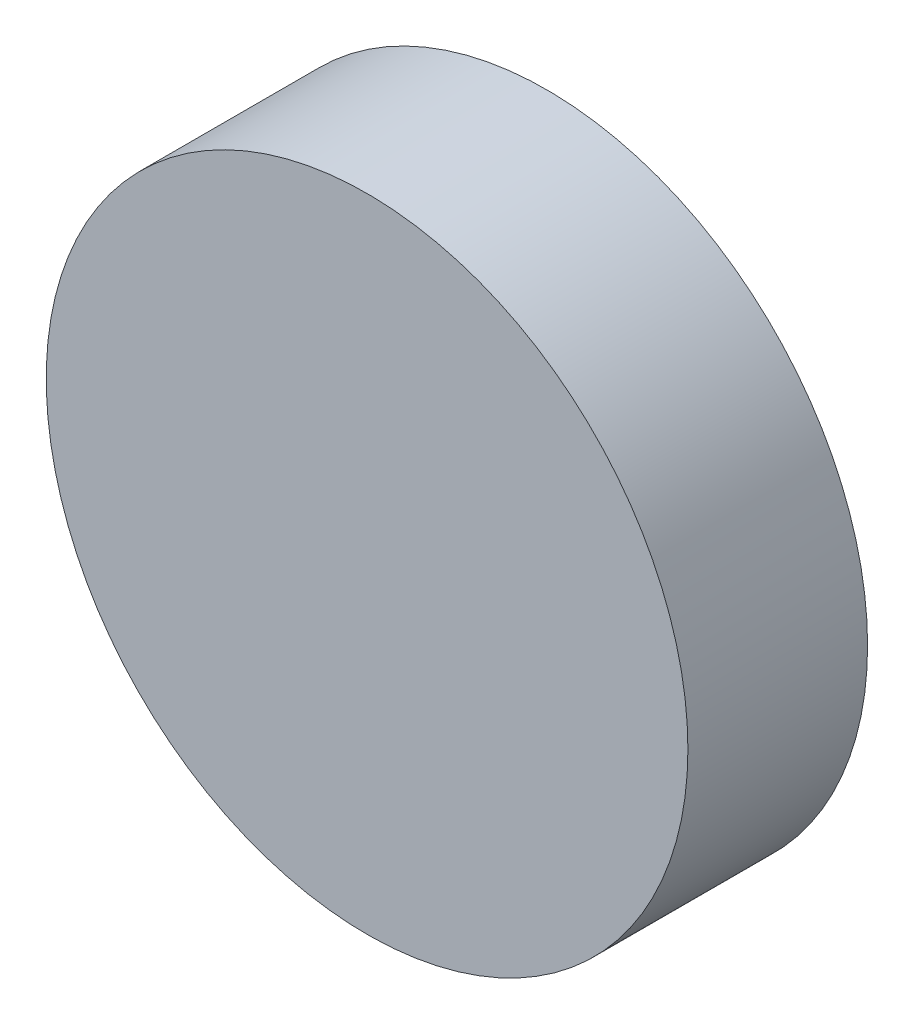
ISO-10303-21;
HEADER;
FILE_DESCRIPTION(('STEP AP214'),'2;1');
FILE_NAME('part.step','',(''),(''),'','','');
FILE_SCHEMA(('AUTOMOTIVE_DESIGN { 1 0 10303 214 1 1 1 1 }'));
ENDSEC;
DATA;
#1=APPLICATION_CONTEXT('core data for automotive mechanical design processes');
#2=APPLICATION_PROTOCOL_DEFINITION('international standard','automotive_design',2000,#1);
#3=PRODUCT_CONTEXT('',#1,'mechanical');
#4=PRODUCT('Part','Part','',(#3));
#5=PRODUCT_RELATED_PRODUCT_CATEGORY('part','',(#4));
#6=PRODUCT_DEFINITION_FORMATION('','',#4);
#7=PRODUCT_DEFINITION_CONTEXT('part definition',#1,'design');
#8=PRODUCT_DEFINITION('design','',#6,#7);
#9=PRODUCT_DEFINITION_SHAPE('','',#8);
#10=(LENGTH_UNIT() NAMED_UNIT(*) SI_UNIT(.MILLI.,.METRE.));
#11=(NAMED_UNIT(*) PLANE_ANGLE_UNIT() SI_UNIT($,.RADIAN.));
#12=(NAMED_UNIT(*) SI_UNIT($,.STERADIAN.) SOLID_ANGLE_UNIT());
#13=UNCERTAINTY_MEASURE_WITH_UNIT(LENGTH_MEASURE(1.E-05),#10,'distance_accuracy_value','');
#14=(GEOMETRIC_REPRESENTATION_CONTEXT(3) GLOBAL_UNCERTAINTY_ASSIGNED_CONTEXT((#13)) GLOBAL_UNIT_ASSIGNED_CONTEXT((#10,
#11,#12)) REPRESENTATION_CONTEXT('',''));
#15=CARTESIAN_POINT('',(0.,0.,0.));
#16=DIRECTION('',(0.,0.,1.));
#17=DIRECTION('',(1.,0.,0.));
#18=AXIS2_PLACEMENT_3D('',#15,#16,#17);
#19=CARTESIAN_POINT('',(0.,0.,-17.5));
#20=DIRECTION('',(0.,0.,1.));
#21=DIRECTION('',(1.,0.,0.));
#22=AXIS2_PLACEMENT_3D('',#19,#20,#21);
#23=CYLINDRICAL_SURFACE('',#22,62.5);
#24=CARTESIAN_POINT('',(0.,0.,-17.5));
#25=DIRECTION('',(0.,0.,1.));
#26=DIRECTION('',(1.,0.,0.));
#27=AXIS2_PLACEMENT_3D('',#24,#25,#26);
#28=CIRCLE('',#27,62.5);
#29=CARTESIAN_POINT('',(62.5,0.,-17.5));
#30=VERTEX_POINT('',#29);
#31=EDGE_CURVE('E10',#30,#30,#28,.T.);
#32=ORIENTED_EDGE('',*,*,#31,.T.);
#33=EDGE_LOOP('',(#32));
#34=FACE_BOUND('',#33,.T.);
#35=CARTESIAN_POINT('',(0.,0.,17.5));
#36=DIRECTION('',(0.,0.,1.));
#37=DIRECTION('',(1.,0.,0.));
#38=AXIS2_PLACEMENT_3D('',#35,#36,#37);
#39=CIRCLE('',#38,62.5);
#40=CARTESIAN_POINT('',(62.5,0.,17.5));
#41=VERTEX_POINT('',#40);
#42=EDGE_CURVE('E44',#41,#41,#39,.T.);
#43=ORIENTED_EDGE('',*,*,#42,.F.);
#44=EDGE_LOOP('',(#43));
#45=FACE_BOUND('',#44,.T.);
#46=ADVANCED_FACE('F39',(#34,#45),#23,.T.);
#47=CARTESIAN_POINT('',(0.,0.,-17.5));
#48=DIRECTION('',(0.,0.,1.));
#49=DIRECTION('',(1.,0.,0.));
#50=AXIS2_PLACEMENT_3D('',#47,#48,#49);
#51=PLANE('',#50);
#52=ORIENTED_EDGE('',*,*,#31,.F.);
#53=EDGE_LOOP('',(#52));
#54=FACE_BOUND('',#53,.T.);
#55=ADVANCED_FACE('F53',(#54),#51,.F.);
#56=CARTESIAN_POINT('',(0.,0.,17.5));
#57=DIRECTION('',(0.,0.,1.));
#58=DIRECTION('',(1.,0.,0.));
#59=AXIS2_PLACEMENT_3D('',#56,#57,#58);
#60=PLANE('',#59);
#61=ORIENTED_EDGE('',*,*,#42,.T.);
#62=EDGE_LOOP('',(#61));
#63=FACE_BOUND('',#62,.T.);
#64=ADVANCED_FACE('F51',(#63),#60,.T.);
#65=CLOSED_SHELL('',(#46,#55,#64));
#66=MANIFOLD_SOLID_BREP('B2',#65);
#67=ADVANCED_BREP_SHAPE_REPRESENTATION('',(#18,#66),#14);
#68=SHAPE_DEFINITION_REPRESENTATION(#9,#67);
ENDSEC;
END-ISO-10303-21;
